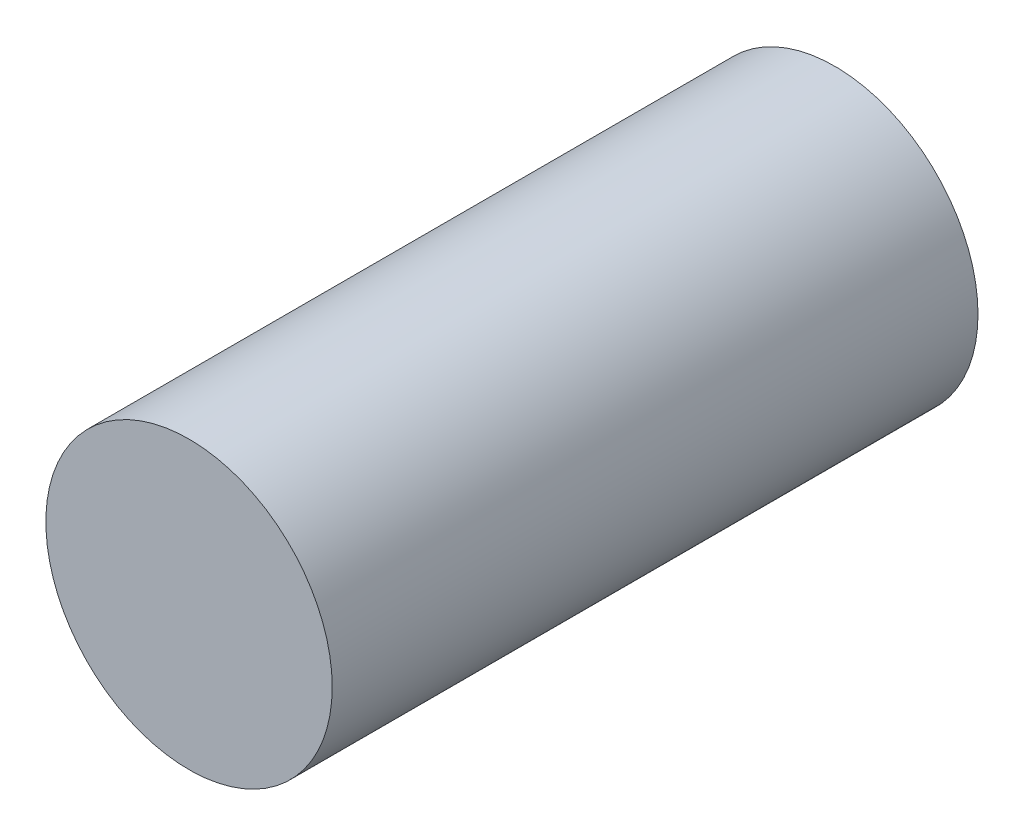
from build123d import *

# Parameters (mm, degrees)
SKIZZE1_R                       = 10
AUFSATZ_LINEAR_AUSTRAGEN1_DEPTH = 45.1


with BuildPart() as part:
    # Skizze1 → Aufsatz-Linear austragen1 (new body)
    with BuildSketch(Plane.XY):
        Circle(SKIZZE1_R)
    extrude(amount=-AUFSATZ_LINEAR_AUSTRAGEN1_DEPTH)


solid = part.part
